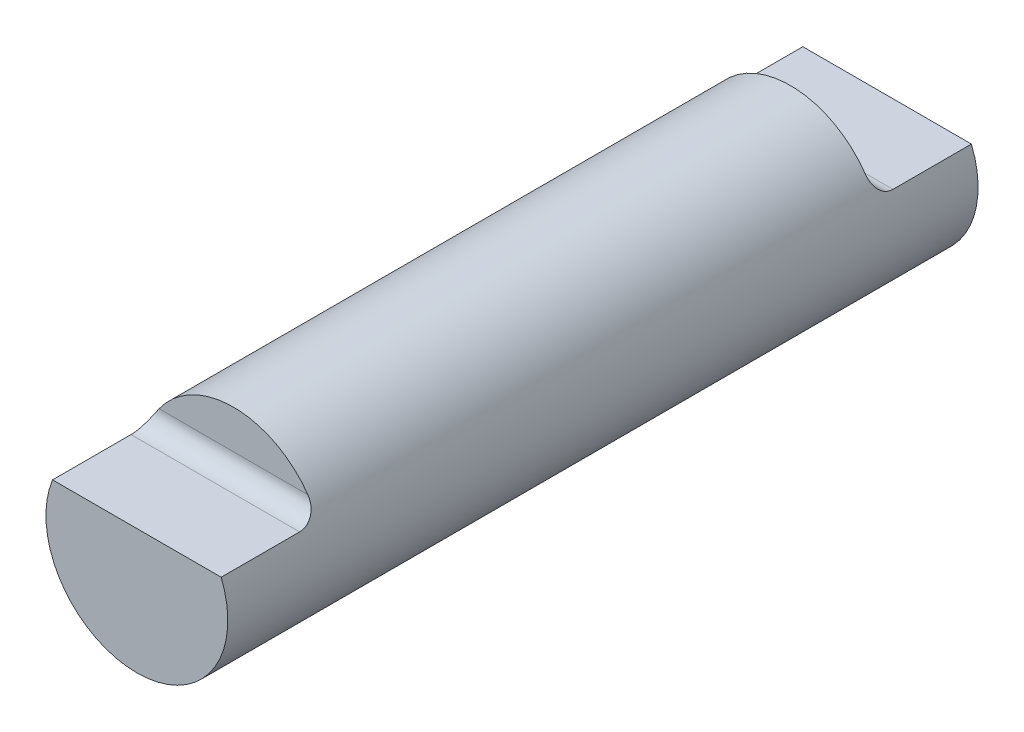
ISO-10303-21;
HEADER;
FILE_DESCRIPTION(('STEP AP214'),'2;1');
FILE_NAME('part.step','',(''),(''),'','','');
FILE_SCHEMA(('AUTOMOTIVE_DESIGN { 1 0 10303 214 1 1 1 1 }'));
ENDSEC;
DATA;
#1=APPLICATION_CONTEXT('core data for automotive mechanical design processes');
#2=APPLICATION_PROTOCOL_DEFINITION('international standard','automotive_design',2000,#1);
#3=PRODUCT_CONTEXT('',#1,'mechanical');
#4=PRODUCT('Part','Part','',(#3));
#5=PRODUCT_RELATED_PRODUCT_CATEGORY('part','',(#4));
#6=PRODUCT_DEFINITION_FORMATION('','',#4);
#7=PRODUCT_DEFINITION_CONTEXT('part definition',#1,'design');
#8=PRODUCT_DEFINITION('design','',#6,#7);
#9=PRODUCT_DEFINITION_SHAPE('','',#8);
#10=(LENGTH_UNIT() NAMED_UNIT(*) SI_UNIT(.MILLI.,.METRE.));
#11=(NAMED_UNIT(*) PLANE_ANGLE_UNIT() SI_UNIT($,.RADIAN.));
#12=(NAMED_UNIT(*) SI_UNIT($,.STERADIAN.) SOLID_ANGLE_UNIT());
#13=UNCERTAINTY_MEASURE_WITH_UNIT(LENGTH_MEASURE(1.E-05),#10,'distance_accuracy_value','');
#14=(GEOMETRIC_REPRESENTATION_CONTEXT(3) GLOBAL_UNCERTAINTY_ASSIGNED_CONTEXT((#13)) GLOBAL_UNIT_ASSIGNED_CONTEXT((#10,
#11,#12)) REPRESENTATION_CONTEXT('',''));
#15=CARTESIAN_POINT('',(0.,0.,0.));
#16=DIRECTION('',(0.,0.,1.));
#17=DIRECTION('',(1.,0.,0.));
#18=AXIS2_PLACEMENT_3D('',#15,#16,#17);
#19=CARTESIAN_POINT('',(0.,0.,-33.));
#20=DIRECTION('',(0.,0.,1.));
#21=DIRECTION('',(1.,0.,0.));
#22=AXIS2_PLACEMENT_3D('',#19,#20,#21);
#23=CYLINDRICAL_SURFACE('',#22,8.);
#24=DIRECTION('',(0.,0.,-1.));
#25=VECTOR('',#24,1.);
#26=CARTESIAN_POINT('',(7.41619848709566,3.,-24.5));
#27=LINE('',#26,#25);
#28=CARTESIAN_POINT('',(7.41619848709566,3.,-26.1));
#29=VERTEX_POINT('',#28);
#30=CARTESIAN_POINT('',(7.41619848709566,3.,-33.));
#31=VERTEX_POINT('',#30);
#32=EDGE_CURVE('E81',#29,#31,#27,.T.);
#33=ORIENTED_EDGE('',*,*,#32,.F.);
#34=CARTESIAN_POINT('',(7.41619848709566,3.,-26.1));
#35=CARTESIAN_POINT('',(7.41619681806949,2.99999883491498,-26.057756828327));
#36=CARTESIAN_POINT('',(7.41552148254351,3.00167417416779,-26.0155343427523));
#37=CARTESIAN_POINT('',(7.41281738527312,3.00834799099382,-25.9314016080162));
#38=CARTESIAN_POINT('',(7.41078878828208,3.01334606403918,-25.8894913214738));
#39=CARTESIAN_POINT('',(7.40267959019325,3.03324127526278,-25.7648633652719));
#40=CARTESIAN_POINT('',(7.39457562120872,3.05303980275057,-25.6829980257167));
#41=CARTESIAN_POINT('',(7.37294388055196,3.1049117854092,-25.5240561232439));
#42=CARTESIAN_POINT('',(7.35941537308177,3.13698690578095,-25.4469802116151));
#43=CARTESIAN_POINT('',(7.32693483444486,3.21211677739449,-25.2996133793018));
#44=CARTESIAN_POINT('',(7.30798193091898,3.2551732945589,-25.2293235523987));
#45=CARTESIAN_POINT('',(7.26435373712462,3.35141687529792,-25.0960491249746));
#46=CARTESIAN_POINT('',(7.23958291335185,3.40477007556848,-25.0332162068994));
#47=CARTESIAN_POINT('',(7.18473988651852,3.51902308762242,-24.917587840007));
#48=CARTESIAN_POINT('',(7.15466818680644,3.57992218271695,-24.8647914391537));
#49=CARTESIAN_POINT('',(7.08755537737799,3.71110558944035,-24.7669700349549));
#50=CARTESIAN_POINT('',(7.05019756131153,3.7817378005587,-24.7226306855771));
#51=CARTESIAN_POINT('',(6.97044784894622,3.92679658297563,-24.6461981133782));
#52=CARTESIAN_POINT('',(6.92804745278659,4.00122943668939,-24.6141259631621));
#53=CARTESIAN_POINT('',(6.83195686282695,4.16347866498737,-24.557950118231));
#54=CARTESIAN_POINT('',(6.77753765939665,4.25156973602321,-24.535873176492));
#55=CARTESIAN_POINT('',(6.6926267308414,4.38309087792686,-24.514148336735));
#56=CARTESIAN_POINT('',(6.66381506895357,4.42677311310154,-24.5088047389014));
#57=CARTESIAN_POINT('',(6.60522242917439,4.51373268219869,-24.5017340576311));
#58=CARTESIAN_POINT('',(6.57544220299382,4.55701029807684,-24.5000042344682));
#59=CARTESIAN_POINT('',(6.54522726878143,4.6,-24.5));
#60=B_SPLINE_CURVE_WITH_KNOTS('',3,(#34,#35,#36,#37,#38,#39,#40,#41,#42,#43,#44,#45,#46,#47,#48,
#49,#50,#51,#52,#53,#54,#55,#56,#57,#58,#59),.UNSPECIFIED.,.F.,.F.,(4,2,2,2,2,2,2,2,2,2,2,2,4),
(0.,0.126650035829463,0.253284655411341,0.505811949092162,0.758373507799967,1.01097570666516,
1.26805821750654,1.52511633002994,1.79812780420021,2.07160617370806,2.38779532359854,
2.54548638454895,2.70305785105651),.UNSPECIFIED.);
#61=CARTESIAN_POINT('',(6.54522726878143,4.6,-24.5));
#62=VERTEX_POINT('',#61);
#63=EDGE_CURVE('E111',#29,#62,#60,.T.);
#64=ORIENTED_EDGE('',*,*,#63,.T.);
#65=CARTESIAN_POINT('',(0.,0.,-24.5));
#66=DIRECTION('',(0.,0.,-1.));
#67=DIRECTION('',(-1.,0.,0.));
#68=AXIS2_PLACEMENT_3D('',#65,#66,#67);
#69=CIRCLE('',#68,8.);
#70=CARTESIAN_POINT('',(-6.54522726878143,4.6,-24.5));
#71=VERTEX_POINT('',#70);
#72=EDGE_CURVE('E87',#71,#62,#69,.T.);
#73=ORIENTED_EDGE('',*,*,#72,.F.);
#74=CARTESIAN_POINT('',(-6.54522726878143,4.6,-24.5));
#75=CARTESIAN_POINT('',(-6.58442616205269,4.54424411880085,-24.4999978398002));
#76=CARTESIAN_POINT('',(-6.62291296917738,4.48794859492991,-24.5029157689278));
#77=CARTESIAN_POINT('',(-6.69821941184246,4.37475031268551,-24.514910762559));
#78=CARTESIAN_POINT('',(-6.73503572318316,4.31784659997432,-24.523999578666));
#79=CARTESIAN_POINT('',(-6.8067242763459,4.20393350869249,-24.5486984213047));
#80=CARTESIAN_POINT('',(-6.84158969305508,4.14692440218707,-24.5643298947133));
#81=CARTESIAN_POINT('',(-6.90888713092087,4.03380827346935,-24.6023395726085));
#82=CARTESIAN_POINT('',(-6.94132145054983,3.97770043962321,-24.6247113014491));
#83=CARTESIAN_POINT('',(-7.01613982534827,3.8446981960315,-24.6868946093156));
#84=CARTESIAN_POINT('',(-7.05721823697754,3.76861135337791,-24.7300991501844));
#85=CARTESIAN_POINT('',(-7.13318435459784,3.62276701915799,-24.8300357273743));
#86=CARTESIAN_POINT('',(-7.16808778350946,3.55299368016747,-24.8867325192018));
#87=CARTESIAN_POINT('',(-7.23145403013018,3.42219060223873,-25.0132250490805));
#88=CARTESIAN_POINT('',(-7.25988300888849,3.36120738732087,-25.0830862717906));
#89=CARTESIAN_POINT('',(-7.30974977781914,3.25134132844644,-25.2340712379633));
#90=CARTESIAN_POINT('',(-7.33118302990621,3.2024663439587,-25.3152022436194));
#91=CARTESIAN_POINT('',(-7.36541674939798,3.12287694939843,-25.4789496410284));
#92=CARTESIAN_POINT('',(-7.37878749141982,3.09098912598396,-25.5608796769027));
#93=CARTESIAN_POINT('',(-7.39952289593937,3.04102049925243,-25.729485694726));
#94=CARTESIAN_POINT('',(-7.4068986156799,3.02291428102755,-25.8161526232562));
#95=CARTESIAN_POINT('',(-7.41293540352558,3.00805580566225,-25.9363003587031));
#96=CARTESIAN_POINT('',(-7.41416021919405,3.00503453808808,-25.9689830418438));
#97=CARTESIAN_POINT('',(-7.4157905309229,3.0010091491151,-26.0344385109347));
#98=CARTESIAN_POINT('',(-7.41619737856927,3.00000170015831,-26.0672110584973));
#99=CARTESIAN_POINT('',(-7.41619848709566,3.,-26.1));
#100=B_SPLINE_CURVE_WITH_KNOTS('',3,(#74,#75,#76,#77,#78,#79,#80,#81,#82,#83,#84,#85,#86,#87,
#88,#89,#90,#91,#92,#93,#94,#95,#96,#97,#98,#99),.UNSPECIFIED.,.F.,.F.,(4,2,2,2,2,2,2,2,2,2,2,2,
4),(0.,0.204447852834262,0.409286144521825,0.614801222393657,0.820119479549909,1.10878307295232,
1.39670073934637,1.68609034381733,1.9756673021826,2.24112898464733,2.50609993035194,
2.60457893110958,2.70289507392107),.UNSPECIFIED.);
#101=CARTESIAN_POINT('',(-7.41619848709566,3.,-26.1));
#102=VERTEX_POINT('',#101);
#103=EDGE_CURVE('E77',#71,#102,#100,.T.);
#104=ORIENTED_EDGE('',*,*,#103,.T.);
#105=DIRECTION('',(0.,0.,-1.));
#106=VECTOR('',#105,1.);
#107=CARTESIAN_POINT('',(-7.41619848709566,3.,-24.5));
#108=LINE('',#107,#106);
#109=CARTESIAN_POINT('',(-7.41619848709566,3.,-33.));
#110=VERTEX_POINT('',#109);
#111=EDGE_CURVE('E71',#102,#110,#108,.T.);
#112=ORIENTED_EDGE('',*,*,#111,.T.);
#113=CARTESIAN_POINT('',(0.,0.,-33.));
#114=DIRECTION('',(0.,0.,1.));
#115=DIRECTION('',(1.,0.,0.));
#116=AXIS2_PLACEMENT_3D('',#113,#114,#115);
#117=CIRCLE('',#116,8.);
#118=EDGE_CURVE('E75',#110,#31,#117,.T.);
#119=ORIENTED_EDGE('',*,*,#118,.T.);
#120=EDGE_LOOP('',(#33,#64,#73,#104,#112,#119));
#121=FACE_BOUND('',#120,.T.);
#122=CARTESIAN_POINT('',(0.,0.,24.5));
#123=DIRECTION('',(0.,0.,1.));
#124=DIRECTION('',(1.,0.,0.));
#125=AXIS2_PLACEMENT_3D('',#122,#123,#124);
#126=CIRCLE('',#125,8.);
#127=CARTESIAN_POINT('',(6.54522726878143,4.6,24.5));
#128=VERTEX_POINT('',#127);
#129=CARTESIAN_POINT('',(-6.54522726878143,4.6,24.5));
#130=VERTEX_POINT('',#129);
#131=EDGE_CURVE('E167',#128,#130,#126,.T.);
#132=ORIENTED_EDGE('',*,*,#131,.F.);
#133=CARTESIAN_POINT('',(6.54522726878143,4.6,24.5));
#134=CARTESIAN_POINT('',(6.58442616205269,4.54424411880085,24.4999978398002));
#135=CARTESIAN_POINT('',(6.62291296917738,4.48794859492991,24.5029157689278));
#136=CARTESIAN_POINT('',(6.69821941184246,4.37475031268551,24.514910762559));
#137=CARTESIAN_POINT('',(6.73503572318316,4.31784659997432,24.523999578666));
#138=CARTESIAN_POINT('',(6.8067242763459,4.20393350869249,24.5486984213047));
#139=CARTESIAN_POINT('',(6.84158969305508,4.14692440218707,24.5643298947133));
#140=CARTESIAN_POINT('',(6.90888713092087,4.03380827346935,24.6023395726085));
#141=CARTESIAN_POINT('',(6.94132145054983,3.97770043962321,24.6247113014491));
#142=CARTESIAN_POINT('',(7.01613982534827,3.8446981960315,24.6868946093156));
#143=CARTESIAN_POINT('',(7.05721823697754,3.76861135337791,24.7300991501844));
#144=CARTESIAN_POINT('',(7.13318435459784,3.62276701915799,24.8300357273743));
#145=CARTESIAN_POINT('',(7.16808778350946,3.55299368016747,24.8867325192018));
#146=CARTESIAN_POINT('',(7.23145403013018,3.42219060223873,25.0132250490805));
#147=CARTESIAN_POINT('',(7.25988300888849,3.36120738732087,25.0830862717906));
#148=CARTESIAN_POINT('',(7.30974977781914,3.25134132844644,25.2340712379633));
#149=CARTESIAN_POINT('',(7.33118302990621,3.2024663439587,25.3152022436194));
#150=CARTESIAN_POINT('',(7.36541674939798,3.12287694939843,25.4789496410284));
#151=CARTESIAN_POINT('',(7.37878749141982,3.09098912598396,25.5608796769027));
#152=CARTESIAN_POINT('',(7.39952289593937,3.04102049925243,25.729485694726));
#153=CARTESIAN_POINT('',(7.4068986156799,3.02291428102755,25.8161526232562));
#154=CARTESIAN_POINT('',(7.41293540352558,3.00805580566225,25.9363003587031));
#155=CARTESIAN_POINT('',(7.41416021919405,3.00503453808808,25.9689830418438));
#156=CARTESIAN_POINT('',(7.4157905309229,3.0010091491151,26.0344385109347));
#157=CARTESIAN_POINT('',(7.41619737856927,3.00000170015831,26.0672110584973));
#158=CARTESIAN_POINT('',(7.41619848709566,3.,26.1));
#159=B_SPLINE_CURVE_WITH_KNOTS('',3,(#133,#134,#135,#136,#137,#138,#139,#140,#141,#142,#143,
#144,#145,#146,#147,#148,#149,#150,#151,#152,#153,#154,#155,#156,#157,#158),.UNSPECIFIED.,.F.,
.F.,(4,2,2,2,2,2,2,2,2,2,2,2,4),(0.,0.204447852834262,0.409286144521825,0.614801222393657,
0.820119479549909,1.10878307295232,1.39670073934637,1.68609034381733,1.9756673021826,
2.24112898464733,2.50609993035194,2.60457893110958,2.70289507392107),.UNSPECIFIED.);
#160=CARTESIAN_POINT('',(7.41619848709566,3.,26.1));
#161=VERTEX_POINT('',#160);
#162=EDGE_CURVE('E28',#128,#161,#159,.T.);
#163=ORIENTED_EDGE('',*,*,#162,.T.);
#164=DIRECTION('',(0.,0.,1.));
#165=VECTOR('',#164,1.);
#166=CARTESIAN_POINT('',(7.41619848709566,3.,24.5));
#167=LINE('',#166,#165);
#168=CARTESIAN_POINT('',(7.41619848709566,3.,33.));
#169=VERTEX_POINT('',#168);
#170=EDGE_CURVE('E97',#161,#169,#167,.T.);
#171=ORIENTED_EDGE('',*,*,#170,.T.);
#172=CARTESIAN_POINT('',(0.,0.,33.));
#173=DIRECTION('',(0.,0.,1.));
#174=DIRECTION('',(1.,0.,0.));
#175=AXIS2_PLACEMENT_3D('',#172,#173,#174);
#176=CIRCLE('',#175,8.);
#177=CARTESIAN_POINT('',(-7.41619848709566,3.,33.));
#178=VERTEX_POINT('',#177);
#179=EDGE_CURVE('E91',#178,#169,#176,.T.);
#180=ORIENTED_EDGE('',*,*,#179,.F.);
#181=DIRECTION('',(0.,0.,1.));
#182=VECTOR('',#181,1.);
#183=CARTESIAN_POINT('',(-7.41619848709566,3.,24.5));
#184=LINE('',#183,#182);
#185=CARTESIAN_POINT('',(-7.41619848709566,3.,26.1));
#186=VERTEX_POINT('',#185);
#187=EDGE_CURVE('E169',#186,#178,#184,.T.);
#188=ORIENTED_EDGE('',*,*,#187,.F.);
#189=CARTESIAN_POINT('',(-7.41619848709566,3.,26.1));
#190=CARTESIAN_POINT('',(-7.41619681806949,2.99999883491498,26.057756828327));
#191=CARTESIAN_POINT('',(-7.41552148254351,3.00167417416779,26.0155343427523));
#192=CARTESIAN_POINT('',(-7.41281738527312,3.00834799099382,25.9314016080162));
#193=CARTESIAN_POINT('',(-7.41078878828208,3.01334606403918,25.8894913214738));
#194=CARTESIAN_POINT('',(-7.40267959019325,3.03324127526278,25.7648633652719));
#195=CARTESIAN_POINT('',(-7.39457562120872,3.05303980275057,25.6829980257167));
#196=CARTESIAN_POINT('',(-7.37294388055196,3.1049117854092,25.5240561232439));
#197=CARTESIAN_POINT('',(-7.35941537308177,3.13698690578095,25.4469802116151));
#198=CARTESIAN_POINT('',(-7.32693483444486,3.21211677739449,25.2996133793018));
#199=CARTESIAN_POINT('',(-7.30798193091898,3.2551732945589,25.2293235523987));
#200=CARTESIAN_POINT('',(-7.26435373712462,3.35141687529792,25.0960491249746));
#201=CARTESIAN_POINT('',(-7.23958291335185,3.40477007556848,25.0332162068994));
#202=CARTESIAN_POINT('',(-7.18473988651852,3.51902308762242,24.917587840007));
#203=CARTESIAN_POINT('',(-7.15466818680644,3.57992218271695,24.8647914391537));
#204=CARTESIAN_POINT('',(-7.08755537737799,3.71110558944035,24.7669700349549));
#205=CARTESIAN_POINT('',(-7.05019756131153,3.7817378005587,24.7226306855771));
#206=CARTESIAN_POINT('',(-6.97044784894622,3.92679658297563,24.6461981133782));
#207=CARTESIAN_POINT('',(-6.92804745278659,4.00122943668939,24.6141259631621));
#208=CARTESIAN_POINT('',(-6.83195686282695,4.16347866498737,24.557950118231));
#209=CARTESIAN_POINT('',(-6.77753765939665,4.25156973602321,24.535873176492));
#210=CARTESIAN_POINT('',(-6.6926267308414,4.38309087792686,24.514148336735));
#211=CARTESIAN_POINT('',(-6.66381506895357,4.42677311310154,24.5088047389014));
#212=CARTESIAN_POINT('',(-6.60522242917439,4.51373268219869,24.5017340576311));
#213=CARTESIAN_POINT('',(-6.57544220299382,4.55701029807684,24.5000042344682));
#214=CARTESIAN_POINT('',(-6.54522726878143,4.6,24.5));
#215=B_SPLINE_CURVE_WITH_KNOTS('',3,(#189,#190,#191,#192,#193,#194,#195,#196,#197,#198,#199,
#200,#201,#202,#203,#204,#205,#206,#207,#208,#209,#210,#211,#212,#213,#214),.UNSPECIFIED.,.F.,
.F.,(4,2,2,2,2,2,2,2,2,2,2,2,4),(0.,0.126650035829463,0.253284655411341,0.505811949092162,
0.758373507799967,1.01097570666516,1.26805821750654,1.52511633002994,1.79812780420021,
2.07160617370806,2.38779532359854,2.54548638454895,2.70305785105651),.UNSPECIFIED.);
#216=EDGE_CURVE('E9',#186,#130,#215,.T.);
#217=ORIENTED_EDGE('',*,*,#216,.T.);
#218=EDGE_LOOP('',(#132,#163,#171,#180,#188,#217));
#219=FACE_BOUND('',#218,.T.);
#220=ADVANCED_FACE('F14',(#121,#219),#23,.T.);
#221=CARTESIAN_POINT('',(8.,0.,-33.));
#222=DIRECTION('',(0.,0.,-1.));
#223=DIRECTION('',(-1.,0.,0.));
#224=AXIS2_PLACEMENT_3D('',#221,#222,#223);
#225=PLANE('',#224);
#226=DIRECTION('',(-1.,0.,0.));
#227=VECTOR('',#226,1.);
#228=CARTESIAN_POINT('',(7.41619848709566,3.,-33.));
#229=LINE('',#228,#227);
#230=EDGE_CURVE('E84',#31,#110,#229,.T.);
#231=ORIENTED_EDGE('',*,*,#230,.F.);
#232=ORIENTED_EDGE('',*,*,#118,.F.);
#233=EDGE_LOOP('',(#231,#232));
#234=FACE_BOUND('',#233,.T.);
#235=ADVANCED_FACE('F89',(#234),#225,.T.);
#236=CARTESIAN_POINT('',(0.,0.,33.));
#237=DIRECTION('',(0.,0.,1.));
#238=DIRECTION('',(1.,0.,0.));
#239=AXIS2_PLACEMENT_3D('',#236,#237,#238);
#240=PLANE('',#239);
#241=DIRECTION('',(1.,0.,0.));
#242=VECTOR('',#241,1.);
#243=CARTESIAN_POINT('',(-7.41619848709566,3.,33.));
#244=LINE('',#243,#242);
#245=EDGE_CURVE('E80',#178,#169,#244,.T.);
#246=ORIENTED_EDGE('',*,*,#245,.F.);
#247=ORIENTED_EDGE('',*,*,#179,.T.);
#248=EDGE_LOOP('',(#246,#247));
#249=FACE_BOUND('',#248,.T.);
#250=ADVANCED_FACE('F157',(#249),#240,.T.);
#251=CARTESIAN_POINT('',(-7.41619848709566,3.,24.5));
#252=DIRECTION('',(0.,-1.,0.));
#253=DIRECTION('',(0.,0.,-1.));
#254=AXIS2_PLACEMENT_3D('',#251,#252,#253);
#255=PLANE('',#254);
#256=ORIENTED_EDGE('',*,*,#170,.F.);
#257=DIRECTION('',(1.,0.,0.));
#258=VECTOR('',#257,1.);
#259=CARTESIAN_POINT('',(-7.41619848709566,3.,26.1));
#260=LINE('',#259,#258);
#261=EDGE_CURVE('E35',#161,#186,#260,.F.);
#262=ORIENTED_EDGE('',*,*,#261,.T.);
#263=ORIENTED_EDGE('',*,*,#187,.T.);
#264=ORIENTED_EDGE('',*,*,#245,.T.);
#265=EDGE_LOOP('',(#256,#262,#263,#264));
#266=FACE_BOUND('',#265,.T.);
#267=ADVANCED_FACE('F154',(#266),#255,.F.);
#268=CARTESIAN_POINT('',(0.,0.,24.5));
#269=DIRECTION('',(0.,0.,1.));
#270=DIRECTION('',(1.,0.,0.));
#271=AXIS2_PLACEMENT_3D('',#268,#269,#270);
#272=PLANE('',#271);
#273=ORIENTED_EDGE('',*,*,#131,.T.);
#274=DIRECTION('',(1.,0.,0.));
#275=VECTOR('',#274,1.);
#276=CARTESIAN_POINT('',(0.,4.6,24.5));
#277=LINE('',#276,#275);
#278=EDGE_CURVE('E102',#130,#128,#277,.T.);
#279=ORIENTED_EDGE('',*,*,#278,.T.);
#280=EDGE_LOOP('',(#273,#279));
#281=FACE_BOUND('',#280,.T.);
#282=ADVANCED_FACE('F149',(#281),#272,.T.);
#283=CARTESIAN_POINT('',(7.41619848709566,3.,-24.5));
#284=DIRECTION('',(0.,-1.,0.));
#285=DIRECTION('',(0.,0.,-1.));
#286=AXIS2_PLACEMENT_3D('',#283,#284,#285);
#287=PLANE('',#286);
#288=ORIENTED_EDGE('',*,*,#111,.F.);
#289=DIRECTION('',(-1.,0.,0.));
#290=VECTOR('',#289,1.);
#291=CARTESIAN_POINT('',(7.41619848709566,3.,-26.1));
#292=LINE('',#291,#290);
#293=EDGE_CURVE('E94',#102,#29,#292,.F.);
#294=ORIENTED_EDGE('',*,*,#293,.T.);
#295=ORIENTED_EDGE('',*,*,#32,.T.);
#296=ORIENTED_EDGE('',*,*,#230,.T.);
#297=EDGE_LOOP('',(#288,#294,#295,#296));
#298=FACE_BOUND('',#297,.T.);
#299=ADVANCED_FACE('F85',(#298),#287,.F.);
#300=CARTESIAN_POINT('',(0.,0.,-24.5));
#301=DIRECTION('',(0.,0.,-1.));
#302=DIRECTION('',(-1.,0.,0.));
#303=AXIS2_PLACEMENT_3D('',#300,#301,#302);
#304=PLANE('',#303);
#305=ORIENTED_EDGE('',*,*,#72,.T.);
#306=DIRECTION('',(-1.,0.,0.));
#307=VECTOR('',#306,1.);
#308=CARTESIAN_POINT('',(0.,4.6,-24.5));
#309=LINE('',#308,#307);
#310=EDGE_CURVE('E90',#62,#71,#309,.T.);
#311=ORIENTED_EDGE('',*,*,#310,.T.);
#312=EDGE_LOOP('',(#305,#311));
#313=FACE_BOUND('',#312,.T.);
#314=ADVANCED_FACE('F134',(#313),#304,.T.);
#315=CARTESIAN_POINT('',(0.,4.6,-26.1));
#316=DIRECTION('',(-1.,0.,0.));
#317=DIRECTION('',(0.,0.,1.));
#318=AXIS2_PLACEMENT_3D('',#315,#316,#317);
#319=CYLINDRICAL_SURFACE('',#318,1.6);
#320=ORIENTED_EDGE('',*,*,#63,.F.);
#321=ORIENTED_EDGE('',*,*,#293,.F.);
#322=ORIENTED_EDGE('',*,*,#103,.F.);
#323=ORIENTED_EDGE('',*,*,#310,.F.);
#324=EDGE_LOOP('',(#320,#321,#322,#323));
#325=FACE_BOUND('',#324,.T.);
#326=ADVANCED_FACE('F116',(#325),#319,.F.);
#327=CARTESIAN_POINT('',(0.,4.6,26.1));
#328=DIRECTION('',(1.,0.,0.));
#329=DIRECTION('',(0.,0.,-1.));
#330=AXIS2_PLACEMENT_3D('',#327,#328,#329);
#331=CYLINDRICAL_SURFACE('',#330,1.6);
#332=ORIENTED_EDGE('',*,*,#216,.F.);
#333=ORIENTED_EDGE('',*,*,#261,.F.);
#334=ORIENTED_EDGE('',*,*,#162,.F.);
#335=ORIENTED_EDGE('',*,*,#278,.F.);
#336=EDGE_LOOP('',(#332,#333,#334,#335));
#337=FACE_BOUND('',#336,.T.);
#338=ADVANCED_FACE('F16',(#337),#331,.F.);
#339=CLOSED_SHELL('',(#220,#235,#250,#267,#282,#299,#314,#326,#338));
#340=MANIFOLD_SOLID_BREP('B1',#339);
#341=ADVANCED_BREP_SHAPE_REPRESENTATION('',(#18,#340),#14);
#342=SHAPE_DEFINITION_REPRESENTATION(#9,#341);
ENDSEC;
END-ISO-10303-21;
